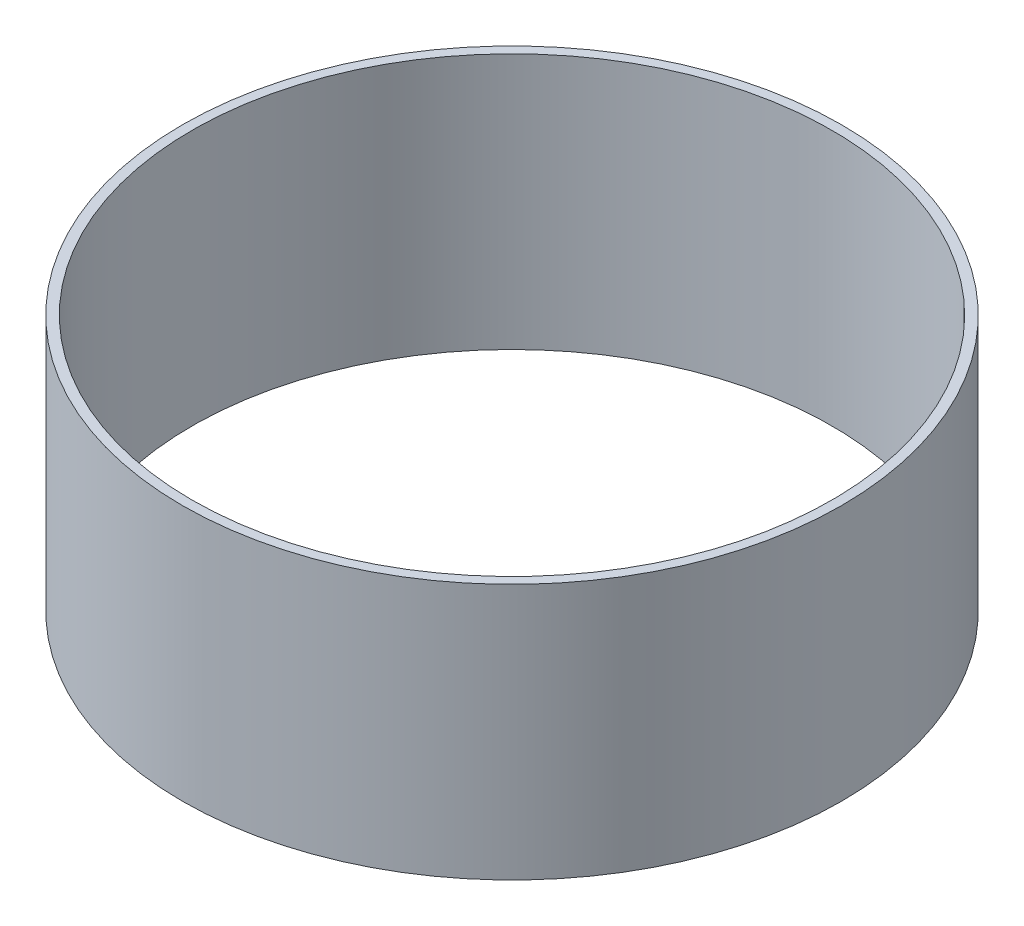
from build123d import *

# Parameters (mm, degrees)
SKETCH1_R           = 65.405
SKETCH1_R_2         = 63.5
BOSS_EXTRUDE1_DEPTH = 25.4


with BuildPart() as part:
    # Sketch1 → Boss-Extrude1 (new, symmetric)
    with BuildSketch(Plane(origin=(0, 0, 0), x_dir=(1, 0, 0), z_dir=(0, 1, 0))):
        with Locations(Location((0, 0, 0), (0, 0, 270))):
            Circle(SKETCH1_R)
        with Locations(Location((0, 0, 0), (0, 0, 270))):
            Circle(SKETCH1_R_2, mode=Mode.SUBTRACT)
    extrude(amount=BOSS_EXTRUDE1_DEPTH, both=True)


solid = part.part
